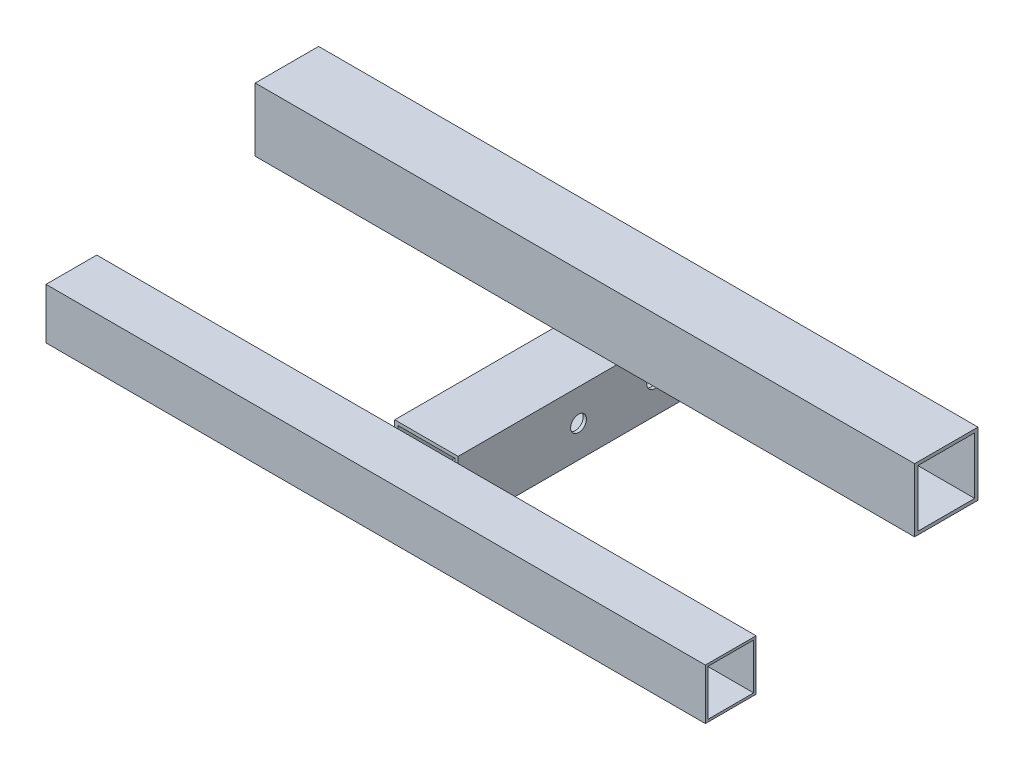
ISO-10303-21;
HEADER;
FILE_DESCRIPTION(('STEP AP214'),'2;1');
FILE_NAME('part.step','',(''),(''),'','','');
FILE_SCHEMA(('AUTOMOTIVE_DESIGN { 1 0 10303 214 1 1 1 1 }'));
ENDSEC;
DATA;
#1=APPLICATION_CONTEXT('core data for automotive mechanical design processes');
#2=APPLICATION_PROTOCOL_DEFINITION('international standard','automotive_design',2000,#1);
#3=PRODUCT_CONTEXT('',#1,'mechanical');
#4=PRODUCT('Part','Part','',(#3));
#5=PRODUCT_RELATED_PRODUCT_CATEGORY('part','',(#4));
#6=PRODUCT_DEFINITION_FORMATION('','',#4);
#7=PRODUCT_DEFINITION_CONTEXT('part definition',#1,'design');
#8=PRODUCT_DEFINITION('design','',#6,#7);
#9=PRODUCT_DEFINITION_SHAPE('','',#8);
#10=(LENGTH_UNIT() NAMED_UNIT(*) SI_UNIT(.MILLI.,.METRE.));
#11=(NAMED_UNIT(*) PLANE_ANGLE_UNIT() SI_UNIT($,.RADIAN.));
#12=(NAMED_UNIT(*) SI_UNIT($,.STERADIAN.) SOLID_ANGLE_UNIT());
#13=UNCERTAINTY_MEASURE_WITH_UNIT(LENGTH_MEASURE(1.E-05),#10,'distance_accuracy_value','');
#14=(GEOMETRIC_REPRESENTATION_CONTEXT(3) GLOBAL_UNCERTAINTY_ASSIGNED_CONTEXT((#13)) GLOBAL_UNIT_ASSIGNED_CONTEXT((#10,
#11,#12)) REPRESENTATION_CONTEXT('',''));
#15=CARTESIAN_POINT('',(0.,0.,0.));
#16=DIRECTION('',(0.,0.,1.));
#17=DIRECTION('',(1.,0.,0.));
#18=AXIS2_PLACEMENT_3D('',#15,#16,#17);
#19=CARTESIAN_POINT('',(165.1,-12.7,-12.7));
#20=DIRECTION('',(1.,0.,0.));
#21=DIRECTION('',(0.,1.,0.));
#22=AXIS2_PLACEMENT_3D('',#19,#20,#21);
#23=PLANE('',#22);
#24=DIRECTION('',(0.,-1.,0.));
#25=VECTOR('',#24,1.);
#26=CARTESIAN_POINT('',(165.1,-12.0904,-11.4808));
#27=LINE('',#26,#25);
#28=CARTESIAN_POINT('',(165.1,11.4808,-11.4808));
#29=VERTEX_POINT('',#28);
#30=CARTESIAN_POINT('',(165.1,-11.4808,-11.4808));
#31=VERTEX_POINT('',#30);
#32=EDGE_CURVE('P0_E181',#29,#31,#27,.T.);
#33=ORIENTED_EDGE('',*,*,#32,.T.);
#34=DIRECTION('',(0.,0.,1.));
#35=VECTOR('',#34,1.);
#36=CARTESIAN_POINT('',(165.1,-11.4808,-12.0904));
#37=LINE('',#36,#35);
#38=CARTESIAN_POINT('',(165.1,-11.4808,11.4808));
#39=VERTEX_POINT('',#38);
#40=EDGE_CURVE('P0_E10',#31,#39,#37,.T.);
#41=ORIENTED_EDGE('',*,*,#40,.T.);
#42=DIRECTION('',(0.,-1.,0.));
#43=VECTOR('',#42,1.);
#44=CARTESIAN_POINT('',(165.1,-12.0904,11.4808));
#45=LINE('',#44,#43);
#46=CARTESIAN_POINT('',(165.1,11.4808,11.4808));
#47=VERTEX_POINT('',#46);
#48=EDGE_CURVE('P0_E45',#47,#39,#45,.T.);
#49=ORIENTED_EDGE('',*,*,#48,.F.);
#50=DIRECTION('',(0.,0.,1.));
#51=VECTOR('',#50,1.);
#52=CARTESIAN_POINT('',(165.1,11.4808,-12.0904));
#53=LINE('',#52,#51);
#54=EDGE_CURVE('P0_E184',#29,#47,#53,.T.);
#55=ORIENTED_EDGE('',*,*,#54,.F.);
#56=EDGE_LOOP('',(#33,#41,#49,#55));
#57=FACE_BOUND('',#56,.T.);
#58=DIRECTION('',(0.,0.,1.));
#59=VECTOR('',#58,1.);
#60=CARTESIAN_POINT('',(165.1,-12.7,-12.7));
#61=LINE('',#60,#59);
#62=CARTESIAN_POINT('',(165.1,-12.7,-12.7));
#63=VERTEX_POINT('',#62);
#64=CARTESIAN_POINT('',(165.1,-12.7,12.7));
#65=VERTEX_POINT('',#64);
#66=EDGE_CURVE('P0_E108',#63,#65,#61,.T.);
#67=ORIENTED_EDGE('',*,*,#66,.F.);
#68=DIRECTION('',(0.,1.,0.));
#69=VECTOR('',#68,1.);
#70=CARTESIAN_POINT('',(165.1,-12.7,-12.7));
#71=LINE('',#70,#69);
#72=CARTESIAN_POINT('',(165.1,12.7,-12.7));
#73=VERTEX_POINT('',#72);
#74=EDGE_CURVE('P0_E139',#63,#73,#71,.T.);
#75=ORIENTED_EDGE('',*,*,#74,.T.);
#76=DIRECTION('',(0.,0.,1.));
#77=VECTOR('',#76,1.);
#78=CARTESIAN_POINT('',(165.1,12.7,-12.7));
#79=LINE('',#78,#77);
#80=CARTESIAN_POINT('',(165.1,12.7,12.7));
#81=VERTEX_POINT('',#80);
#82=EDGE_CURVE('P0_E142',#73,#81,#79,.T.);
#83=ORIENTED_EDGE('',*,*,#82,.T.);
#84=DIRECTION('',(0.,1.,0.));
#85=VECTOR('',#84,1.);
#86=CARTESIAN_POINT('',(165.1,-12.7,12.7));
#87=LINE('',#86,#85);
#88=EDGE_CURVE('P0_E162',#65,#81,#87,.T.);
#89=ORIENTED_EDGE('',*,*,#88,.F.);
#90=EDGE_LOOP('',(#67,#75,#83,#89));
#91=FACE_BOUND('',#90,.T.);
#92=ADVANCED_FACE('P0_F16',(#57,#91),#23,.T.);
#93=CARTESIAN_POINT('',(-190.5,-11.4808,-11.4808));
#94=DIRECTION('',(0.,1.,0.));
#95=DIRECTION('',(1.,0.,0.));
#96=AXIS2_PLACEMENT_3D('',#93,#94,#95);
#97=PLANE('',#96);
#98=DIRECTION('',(1.,0.,0.));
#99=VECTOR('',#98,1.);
#100=CARTESIAN_POINT('',(-190.5,-11.4808,-11.4808));
#101=LINE('',#100,#99);
#102=CARTESIAN_POINT('',(-165.1,-11.4808,-11.4808));
#103=VERTEX_POINT('',#102);
#104=EDGE_CURVE('P0_E178',#103,#31,#101,.T.);
#105=ORIENTED_EDGE('',*,*,#104,.F.);
#106=DIRECTION('',(0.,0.,1.));
#107=VECTOR('',#106,1.);
#108=CARTESIAN_POINT('',(-165.1,-11.4808,-12.0904));
#109=LINE('',#108,#107);
#110=CARTESIAN_POINT('',(-165.1,-11.4808,11.4808));
#111=VERTEX_POINT('',#110);
#112=EDGE_CURVE('P0_E160',#103,#111,#109,.T.);
#113=ORIENTED_EDGE('',*,*,#112,.T.);
#114=DIRECTION('',(1.,0.,0.));
#115=VECTOR('',#114,1.);
#116=CARTESIAN_POINT('',(-190.5,-11.4808,11.4808));
#117=LINE('',#116,#115);
#118=EDGE_CURVE('P0_E20',#111,#39,#117,.T.);
#119=ORIENTED_EDGE('',*,*,#118,.T.);
#120=ORIENTED_EDGE('',*,*,#40,.F.);
#121=EDGE_LOOP('',(#105,#113,#119,#120));
#122=FACE_BOUND('',#121,.T.);
#123=ADVANCED_FACE('P0_F18',(#122),#97,.T.);
#124=CARTESIAN_POINT('',(-190.5,-11.4808,11.4808));
#125=DIRECTION('',(0.,0.,1.));
#126=DIRECTION('',(1.,0.,0.));
#127=AXIS2_PLACEMENT_3D('',#124,#125,#126);
#128=PLANE('',#127);
#129=ORIENTED_EDGE('',*,*,#48,.T.);
#130=ORIENTED_EDGE('',*,*,#118,.F.);
#131=DIRECTION('',(0.,-1.,0.));
#132=VECTOR('',#131,1.);
#133=CARTESIAN_POINT('',(-165.1,-12.0904,11.4808));
#134=LINE('',#133,#132);
#135=CARTESIAN_POINT('',(-165.1,11.4808,11.4808));
#136=VERTEX_POINT('',#135);
#137=EDGE_CURVE('P0_E155',#136,#111,#134,.T.);
#138=ORIENTED_EDGE('',*,*,#137,.F.);
#139=DIRECTION('',(1.,0.,0.));
#140=VECTOR('',#139,1.);
#141=CARTESIAN_POINT('',(-190.5,11.4808,11.4808));
#142=LINE('',#141,#140);
#143=EDGE_CURVE('P0_E188',#136,#47,#142,.T.);
#144=ORIENTED_EDGE('',*,*,#143,.T.);
#145=EDGE_LOOP('',(#129,#130,#138,#144));
#146=FACE_BOUND('',#145,.T.);
#147=ADVANCED_FACE('P0_F203',(#146),#128,.F.);
#148=CARTESIAN_POINT('',(-190.5,11.4808,-11.4808));
#149=DIRECTION('',(0.,1.,0.));
#150=DIRECTION('',(1.,0.,0.));
#151=AXIS2_PLACEMENT_3D('',#148,#149,#150);
#152=PLANE('',#151);
#153=ORIENTED_EDGE('',*,*,#54,.T.);
#154=ORIENTED_EDGE('',*,*,#143,.F.);
#155=DIRECTION('',(0.,0.,1.));
#156=VECTOR('',#155,1.);
#157=CARTESIAN_POINT('',(-165.1,11.4808,-12.0904));
#158=LINE('',#157,#156);
#159=CARTESIAN_POINT('',(-165.1,11.4808,-11.4808));
#160=VERTEX_POINT('',#159);
#161=EDGE_CURVE('P0_E122',#160,#136,#158,.T.);
#162=ORIENTED_EDGE('',*,*,#161,.F.);
#163=DIRECTION('',(1.,0.,0.));
#164=VECTOR('',#163,1.);
#165=CARTESIAN_POINT('',(-190.5,11.4808,-11.4808));
#166=LINE('',#165,#164);
#167=EDGE_CURVE('P0_E173',#160,#29,#166,.T.);
#168=ORIENTED_EDGE('',*,*,#167,.T.);
#169=EDGE_LOOP('',(#153,#154,#162,#168));
#170=FACE_BOUND('',#169,.T.);
#171=ADVANCED_FACE('P0_F206',(#170),#152,.F.);
#172=CARTESIAN_POINT('',(-190.5,-11.4808,-11.4808));
#173=DIRECTION('',(0.,0.,1.));
#174=DIRECTION('',(1.,0.,0.));
#175=AXIS2_PLACEMENT_3D('',#172,#173,#174);
#176=PLANE('',#175);
#177=ORIENTED_EDGE('',*,*,#167,.F.);
#178=DIRECTION('',(0.,-1.,0.));
#179=VECTOR('',#178,1.);
#180=CARTESIAN_POINT('',(-165.1,-12.0904,-11.4808));
#181=LINE('',#180,#179);
#182=EDGE_CURVE('P0_E146',#160,#103,#181,.T.);
#183=ORIENTED_EDGE('',*,*,#182,.T.);
#184=ORIENTED_EDGE('',*,*,#104,.T.);
#185=ORIENTED_EDGE('',*,*,#32,.F.);
#186=EDGE_LOOP('',(#177,#183,#184,#185));
#187=FACE_BOUND('',#186,.T.);
#188=ADVANCED_FACE('P0_F209',(#187),#176,.T.);
#189=CARTESIAN_POINT('',(-165.1,12.7,-12.7));
#190=DIRECTION('',(0.,1.,0.));
#191=DIRECTION('',(1.,0.,0.));
#192=AXIS2_PLACEMENT_3D('',#189,#190,#191);
#193=PLANE('',#192);
#194=DIRECTION('',(1.,0.,0.));
#195=VECTOR('',#194,1.);
#196=CARTESIAN_POINT('',(-165.1,12.7,-12.7));
#197=LINE('',#196,#195);
#198=CARTESIAN_POINT('',(-165.1,12.7,-12.7));
#199=VERTEX_POINT('',#198);
#200=EDGE_CURVE('P0_E141',#199,#73,#197,.T.);
#201=ORIENTED_EDGE('',*,*,#200,.F.);
#202=DIRECTION('',(0.,0.,1.));
#203=VECTOR('',#202,1.);
#204=CARTESIAN_POINT('',(-165.1,12.7,-12.7));
#205=LINE('',#204,#203);
#206=CARTESIAN_POINT('',(-165.1,12.7,12.7));
#207=VERTEX_POINT('',#206);
#208=EDGE_CURVE('P0_E131',#199,#207,#205,.T.);
#209=ORIENTED_EDGE('',*,*,#208,.T.);
#210=DIRECTION('',(1.,0.,0.));
#211=VECTOR('',#210,1.);
#212=CARTESIAN_POINT('',(-165.1,12.7,12.7));
#213=LINE('',#212,#211);
#214=EDGE_CURVE('P0_E128',#207,#81,#213,.T.);
#215=ORIENTED_EDGE('',*,*,#214,.T.);
#216=ORIENTED_EDGE('',*,*,#82,.F.);
#217=EDGE_LOOP('',(#201,#209,#215,#216));
#218=FACE_BOUND('',#217,.T.);
#219=ADVANCED_FACE('P0_F215',(#218),#193,.T.);
#220=CARTESIAN_POINT('',(-165.1,-12.7,-12.7));
#221=DIRECTION('',(0.,0.,1.));
#222=DIRECTION('',(1.,0.,0.));
#223=AXIS2_PLACEMENT_3D('',#220,#221,#222);
#224=PLANE('',#223);
#225=ORIENTED_EDGE('',*,*,#200,.T.);
#226=ORIENTED_EDGE('',*,*,#74,.F.);
#227=DIRECTION('',(1.,0.,0.));
#228=VECTOR('',#227,1.);
#229=CARTESIAN_POINT('',(-165.1,-12.7,-12.7));
#230=LINE('',#229,#228);
#231=CARTESIAN_POINT('',(-165.1,-12.7,-12.7));
#232=VERTEX_POINT('',#231);
#233=EDGE_CURVE('P0_E111',#232,#63,#230,.T.);
#234=ORIENTED_EDGE('',*,*,#233,.F.);
#235=DIRECTION('',(0.,1.,0.));
#236=VECTOR('',#235,1.);
#237=CARTESIAN_POINT('',(-165.1,-12.7,-12.7));
#238=LINE('',#237,#236);
#239=EDGE_CURVE('P0_E125',#232,#199,#238,.T.);
#240=ORIENTED_EDGE('',*,*,#239,.T.);
#241=EDGE_LOOP('',(#225,#226,#234,#240));
#242=FACE_BOUND('',#241,.T.);
#243=ADVANCED_FACE('P0_F218',(#242),#224,.F.);
#244=CARTESIAN_POINT('',(-165.1,-12.7,12.7));
#245=DIRECTION('',(0.,0.,1.));
#246=DIRECTION('',(1.,0.,0.));
#247=AXIS2_PLACEMENT_3D('',#244,#245,#246);
#248=PLANE('',#247);
#249=DIRECTION('',(0.,1.,0.));
#250=VECTOR('',#249,1.);
#251=CARTESIAN_POINT('',(-165.1,-12.7,12.7));
#252=LINE('',#251,#250);
#253=CARTESIAN_POINT('',(-165.1,-12.7,12.7));
#254=VERTEX_POINT('',#253);
#255=EDGE_CURVE('P0_E120',#254,#207,#252,.T.);
#256=ORIENTED_EDGE('',*,*,#255,.F.);
#257=DIRECTION('',(1.,0.,0.));
#258=VECTOR('',#257,1.);
#259=CARTESIAN_POINT('',(-165.1,-12.7,12.7));
#260=LINE('',#259,#258);
#261=EDGE_CURVE('P0_E105',#254,#65,#260,.T.);
#262=ORIENTED_EDGE('',*,*,#261,.T.);
#263=ORIENTED_EDGE('',*,*,#88,.T.);
#264=ORIENTED_EDGE('',*,*,#214,.F.);
#265=EDGE_LOOP('',(#256,#262,#263,#264));
#266=FACE_BOUND('',#265,.T.);
#267=ADVANCED_FACE('P0_F130',(#266),#248,.T.);
#268=CARTESIAN_POINT('',(-165.1,-12.7,-12.7));
#269=DIRECTION('',(0.,1.,0.));
#270=DIRECTION('',(1.,0.,0.));
#271=AXIS2_PLACEMENT_3D('',#268,#269,#270);
#272=PLANE('',#271);
#273=ORIENTED_EDGE('',*,*,#66,.T.);
#274=ORIENTED_EDGE('',*,*,#261,.F.);
#275=DIRECTION('',(0.,0.,1.));
#276=VECTOR('',#275,1.);
#277=CARTESIAN_POINT('',(-165.1,-12.7,-12.7));
#278=LINE('',#277,#276);
#279=EDGE_CURVE('P0_E106',#232,#254,#278,.T.);
#280=ORIENTED_EDGE('',*,*,#279,.F.);
#281=ORIENTED_EDGE('',*,*,#233,.T.);
#282=EDGE_LOOP('',(#273,#274,#280,#281));
#283=FACE_BOUND('',#282,.T.);
#284=ADVANCED_FACE('P0_F102',(#283),#272,.F.);
#285=CARTESIAN_POINT('',(-165.1,-12.7,-12.7));
#286=DIRECTION('',(1.,0.,0.));
#287=DIRECTION('',(0.,1.,0.));
#288=AXIS2_PLACEMENT_3D('',#285,#286,#287);
#289=PLANE('',#288);
#290=ORIENTED_EDGE('',*,*,#161,.T.);
#291=ORIENTED_EDGE('',*,*,#137,.T.);
#292=ORIENTED_EDGE('',*,*,#112,.F.);
#293=ORIENTED_EDGE('',*,*,#182,.F.);
#294=EDGE_LOOP('',(#290,#291,#292,#293));
#295=FACE_BOUND('',#294,.T.);
#296=ORIENTED_EDGE('',*,*,#255,.T.);
#297=ORIENTED_EDGE('',*,*,#208,.F.);
#298=ORIENTED_EDGE('',*,*,#239,.F.);
#299=ORIENTED_EDGE('',*,*,#279,.T.);
#300=EDGE_LOOP('',(#296,#297,#298,#299));
#301=FACE_BOUND('',#300,.T.);
#302=ADVANCED_FACE('P0_F119',(#295,#301),#289,.F.);
#303=CLOSED_SHELL('',(#92,#123,#147,#171,#188,#219,#243,#267,#284,#302));
#304=MANIFOLD_SOLID_BREP('P0_B1',#303);
#305=CARTESIAN_POINT('',(-21.59,0.,-73.025));
#306=DIRECTION('',(1.,0.,0.));
#307=DIRECTION('',(0.,0.,1.));
#308=AXIS2_PLACEMENT_3D('',#305,#306,#307);
#309=CYLINDRICAL_SURFACE('',#308,3.96875);
#310=DIRECTION('',(1.,0.,0.));
#311=VECTOR('',#310,1.);
#312=CARTESIAN_POINT('',(-21.59,0.,-69.05625));
#313=LINE('',#312,#311);
#314=CARTESIAN_POINT('',(14.224,0.,-69.05625));
#315=VERTEX_POINT('',#314);
#316=CARTESIAN_POINT('',(15.875,0.,-69.05625));
#317=VERTEX_POINT('',#316);
#318=EDGE_CURVE('P1_E11',#315,#317,#313,.T.);
#319=ORIENTED_EDGE('',*,*,#318,.F.);
#320=CARTESIAN_POINT('',(14.224,0.,-73.025));
#321=DIRECTION('',(1.,0.,0.));
#322=DIRECTION('',(0.,0.,1.));
#323=AXIS2_PLACEMENT_3D('',#320,#321,#322);
#324=CIRCLE('',#323,3.96875);
#325=EDGE_CURVE('P1_E252',#315,#315,#324,.T.);
#326=ORIENTED_EDGE('',*,*,#325,.F.);
#327=ORIENTED_EDGE('',*,*,#318,.T.);
#328=CARTESIAN_POINT('',(15.875,0.,-73.025));
#329=DIRECTION('',(1.,0.,0.));
#330=DIRECTION('',(0.,0.,1.));
#331=AXIS2_PLACEMENT_3D('',#328,#329,#330);
#332=CIRCLE('',#331,3.96875);
#333=EDGE_CURVE('P1_E241',#317,#317,#332,.T.);
#334=ORIENTED_EDGE('',*,*,#333,.T.);
#335=EDGE_LOOP('',(#319,#326,#327,#334));
#336=FACE_BOUND('',#335,.T.);
#337=ADVANCED_FACE('P1_F17',(#336),#309,.F.);
#338=CARTESIAN_POINT('',(-21.59,0.,-111.125));
#339=DIRECTION('',(1.,0.,0.));
#340=DIRECTION('',(0.,0.,1.));
#341=AXIS2_PLACEMENT_3D('',#338,#339,#340);
#342=CYLINDRICAL_SURFACE('',#341,3.96875);
#343=DIRECTION('',(1.,0.,0.));
#344=VECTOR('',#343,1.);
#345=CARTESIAN_POINT('',(-21.59,0.,-107.15625));
#346=LINE('',#345,#344);
#347=CARTESIAN_POINT('',(14.224,0.,-107.15625));
#348=VERTEX_POINT('',#347);
#349=CARTESIAN_POINT('',(15.875,0.,-107.15625));
#350=VERTEX_POINT('',#349);
#351=EDGE_CURVE('P1_E27',#348,#350,#346,.T.);
#352=ORIENTED_EDGE('',*,*,#351,.F.);
#353=CARTESIAN_POINT('',(14.224,0.,-111.125));
#354=DIRECTION('',(1.,0.,0.));
#355=DIRECTION('',(0.,0.,1.));
#356=AXIS2_PLACEMENT_3D('',#353,#354,#355);
#357=CIRCLE('',#356,3.96875);
#358=EDGE_CURVE('P1_E247',#348,#348,#357,.T.);
#359=ORIENTED_EDGE('',*,*,#358,.F.);
#360=ORIENTED_EDGE('',*,*,#351,.T.);
#361=CARTESIAN_POINT('',(15.875,0.,-111.125));
#362=DIRECTION('',(1.,0.,0.));
#363=DIRECTION('',(0.,0.,1.));
#364=AXIS2_PLACEMENT_3D('',#361,#362,#363);
#365=CIRCLE('',#364,3.96875);
#366=EDGE_CURVE('P1_E258',#350,#350,#365,.T.);
#367=ORIENTED_EDGE('',*,*,#366,.T.);
#368=EDGE_LOOP('',(#352,#359,#360,#367));
#369=FACE_BOUND('',#368,.T.);
#370=ADVANCED_FACE('P1_F271',(#369),#342,.F.);
#371=CARTESIAN_POINT('',(-14.224,-14.224,-149.225));
#372=DIRECTION('',(1.,0.,0.));
#373=DIRECTION('',(0.,1.,0.));
#374=AXIS2_PLACEMENT_3D('',#371,#372,#373);
#375=PLANE('',#374);
#376=CARTESIAN_POINT('',(-14.224,0.,-73.025));
#377=DIRECTION('',(1.,0.,0.));
#378=DIRECTION('',(0.,0.,1.));
#379=AXIS2_PLACEMENT_3D('',#376,#377,#378);
#380=CIRCLE('',#379,3.96875);
#381=CARTESIAN_POINT('',(-14.224,0.,-69.05625));
#382=VERTEX_POINT('',#381);
#383=EDGE_CURVE('P1_E248',#382,#382,#380,.T.);
#384=ORIENTED_EDGE('',*,*,#383,.F.);
#385=EDGE_LOOP('',(#384));
#386=FACE_BOUND('',#385,.T.);
#387=CARTESIAN_POINT('',(-14.224,0.,-111.125));
#388=DIRECTION('',(1.,0.,0.));
#389=DIRECTION('',(0.,0.,1.));
#390=AXIS2_PLACEMENT_3D('',#387,#388,#389);
#391=CIRCLE('',#390,3.96875);
#392=CARTESIAN_POINT('',(-14.224,0.,-107.15625));
#393=VERTEX_POINT('',#392);
#394=EDGE_CURVE('P1_E240',#393,#393,#391,.T.);
#395=ORIENTED_EDGE('',*,*,#394,.F.);
#396=EDGE_LOOP('',(#395));
#397=FACE_BOUND('',#396,.T.);
#398=DIRECTION('',(0.,0.,1.));
#399=VECTOR('',#398,1.);
#400=CARTESIAN_POINT('',(-14.224,-14.224,-149.225));
#401=LINE('',#400,#399);
#402=CARTESIAN_POINT('',(-14.224,-14.224,-123.825));
#403=VERTEX_POINT('',#402);
#404=CARTESIAN_POINT('',(-14.224,-14.224,-12.7));
#405=VERTEX_POINT('',#404);
#406=EDGE_CURVE('P1_E239',#403,#405,#401,.T.);
#407=ORIENTED_EDGE('',*,*,#406,.F.);
#408=DIRECTION('',(0.,1.,0.));
#409=VECTOR('',#408,1.);
#410=CARTESIAN_POINT('',(-14.224,-15.0495,-123.825));
#411=LINE('',#410,#409);
#412=CARTESIAN_POINT('',(-14.224,14.224,-123.825));
#413=VERTEX_POINT('',#412);
#414=EDGE_CURVE('P1_E222',#403,#413,#411,.T.);
#415=ORIENTED_EDGE('',*,*,#414,.T.);
#416=DIRECTION('',(0.,0.,1.));
#417=VECTOR('',#416,1.);
#418=CARTESIAN_POINT('',(-14.224,14.224,-149.225));
#419=LINE('',#418,#417);
#420=CARTESIAN_POINT('',(-14.224,14.224,-12.7));
#421=VERTEX_POINT('',#420);
#422=EDGE_CURVE('P1_E270',#413,#421,#419,.T.);
#423=ORIENTED_EDGE('',*,*,#422,.T.);
#424=DIRECTION('',(0.,1.,0.));
#425=VECTOR('',#424,1.);
#426=CARTESIAN_POINT('',(-14.224,-15.0495,-12.7));
#427=LINE('',#426,#425);
#428=EDGE_CURVE('P1_E197',#405,#421,#427,.T.);
#429=ORIENTED_EDGE('',*,*,#428,.F.);
#430=EDGE_LOOP('',(#407,#415,#423,#429));
#431=FACE_BOUND('',#430,.T.);
#432=ADVANCED_FACE('P1_F19',(#386,#397,#431),#375,.T.);
#433=CARTESIAN_POINT('',(-14.224,14.224,-149.225));
#434=DIRECTION('',(0.,1.,0.));
#435=DIRECTION('',(1.,0.,0.));
#436=AXIS2_PLACEMENT_3D('',#433,#434,#435);
#437=PLANE('',#436);
#438=DIRECTION('',(-1.,0.,0.));
#439=VECTOR('',#438,1.);
#440=CARTESIAN_POINT('',(-15.0495,14.224,-12.7));
#441=LINE('',#440,#439);
#442=CARTESIAN_POINT('',(14.224,14.224,-12.7));
#443=VERTEX_POINT('',#442);
#444=EDGE_CURVE('P1_E175',#443,#421,#441,.T.);
#445=ORIENTED_EDGE('',*,*,#444,.T.);
#446=ORIENTED_EDGE('',*,*,#422,.F.);
#447=DIRECTION('',(-1.,0.,0.));
#448=VECTOR('',#447,1.);
#449=CARTESIAN_POINT('',(-15.0495,14.224,-123.825));
#450=LINE('',#449,#448);
#451=CARTESIAN_POINT('',(14.224,14.224,-123.825));
#452=VERTEX_POINT('',#451);
#453=EDGE_CURVE('P1_E220',#452,#413,#450,.T.);
#454=ORIENTED_EDGE('',*,*,#453,.F.);
#455=DIRECTION('',(0.,0.,1.));
#456=VECTOR('',#455,1.);
#457=CARTESIAN_POINT('',(14.224,14.224,-149.225));
#458=LINE('',#457,#456);
#459=EDGE_CURVE('P1_E251',#452,#443,#458,.T.);
#460=ORIENTED_EDGE('',*,*,#459,.T.);
#461=EDGE_LOOP('',(#445,#446,#454,#460));
#462=FACE_BOUND('',#461,.T.);
#463=ADVANCED_FACE('P1_F279',(#462),#437,.F.);
#464=CARTESIAN_POINT('',(14.224,-14.224,-149.225));
#465=DIRECTION('',(1.,0.,0.));
#466=DIRECTION('',(0.,1.,0.));
#467=AXIS2_PLACEMENT_3D('',#464,#465,#466);
#468=PLANE('',#467);
#469=ORIENTED_EDGE('',*,*,#325,.T.);
#470=EDGE_LOOP('',(#469));
#471=FACE_BOUND('',#470,.T.);
#472=ORIENTED_EDGE('',*,*,#358,.T.);
#473=EDGE_LOOP('',(#472));
#474=FACE_BOUND('',#473,.T.);
#475=DIRECTION('',(0.,1.,0.));
#476=VECTOR('',#475,1.);
#477=CARTESIAN_POINT('',(14.224,-15.0495,-12.7));
#478=LINE('',#477,#476);
#479=CARTESIAN_POINT('',(14.224,-14.224,-12.7));
#480=VERTEX_POINT('',#479);
#481=EDGE_CURVE('P1_E203',#480,#443,#478,.T.);
#482=ORIENTED_EDGE('',*,*,#481,.T.);
#483=ORIENTED_EDGE('',*,*,#459,.F.);
#484=DIRECTION('',(0.,1.,0.));
#485=VECTOR('',#484,1.);
#486=CARTESIAN_POINT('',(14.224,-15.0495,-123.825));
#487=LINE('',#486,#485);
#488=CARTESIAN_POINT('',(14.224,-14.224,-123.825));
#489=VERTEX_POINT('',#488);
#490=EDGE_CURVE('P1_E213',#489,#452,#487,.T.);
#491=ORIENTED_EDGE('',*,*,#490,.F.);
#492=DIRECTION('',(0.,0.,1.));
#493=VECTOR('',#492,1.);
#494=CARTESIAN_POINT('',(14.224,-14.224,-149.225));
#495=LINE('',#494,#493);
#496=EDGE_CURVE('P1_E236',#489,#480,#495,.T.);
#497=ORIENTED_EDGE('',*,*,#496,.T.);
#498=EDGE_LOOP('',(#482,#483,#491,#497));
#499=FACE_BOUND('',#498,.T.);
#500=ADVANCED_FACE('P1_F273',(#471,#474,#499),#468,.F.);
#501=CARTESIAN_POINT('',(-14.224,-14.224,-149.225));
#502=DIRECTION('',(0.,1.,0.));
#503=DIRECTION('',(1.,0.,0.));
#504=AXIS2_PLACEMENT_3D('',#501,#502,#503);
#505=PLANE('',#504);
#506=ORIENTED_EDGE('',*,*,#496,.F.);
#507=DIRECTION('',(-1.,0.,0.));
#508=VECTOR('',#507,1.);
#509=CARTESIAN_POINT('',(-15.0495,-14.224,-123.825));
#510=LINE('',#509,#508);
#511=EDGE_CURVE('P1_E223',#489,#403,#510,.T.);
#512=ORIENTED_EDGE('',*,*,#511,.T.);
#513=ORIENTED_EDGE('',*,*,#406,.T.);
#514=DIRECTION('',(-1.,0.,0.));
#515=VECTOR('',#514,1.);
#516=CARTESIAN_POINT('',(-15.0495,-14.224,-12.7));
#517=LINE('',#516,#515);
#518=EDGE_CURVE('P1_E176',#480,#405,#517,.T.);
#519=ORIENTED_EDGE('',*,*,#518,.F.);
#520=EDGE_LOOP('',(#506,#512,#513,#519));
#521=FACE_BOUND('',#520,.T.);
#522=ADVANCED_FACE('P1_F280',(#521),#505,.T.);
#523=CARTESIAN_POINT('',(15.875,-15.875,-123.825));
#524=DIRECTION('',(1.,0.,0.));
#525=DIRECTION('',(0.,1.,0.));
#526=AXIS2_PLACEMENT_3D('',#523,#524,#525);
#527=PLANE('',#526);
#528=ORIENTED_EDGE('',*,*,#333,.F.);
#529=EDGE_LOOP('',(#528));
#530=FACE_BOUND('',#529,.T.);
#531=ORIENTED_EDGE('',*,*,#366,.F.);
#532=EDGE_LOOP('',(#531));
#533=FACE_BOUND('',#532,.T.);
#534=DIRECTION('',(0.,0.,1.));
#535=VECTOR('',#534,1.);
#536=CARTESIAN_POINT('',(15.875,-15.875,-123.825));
#537=LINE('',#536,#535);
#538=CARTESIAN_POINT('',(15.875,-15.875,-123.825));
#539=VERTEX_POINT('',#538);
#540=CARTESIAN_POINT('',(15.875,-15.875,-12.7));
#541=VERTEX_POINT('',#540);
#542=EDGE_CURVE('P1_E145',#539,#541,#537,.T.);
#543=ORIENTED_EDGE('',*,*,#542,.F.);
#544=DIRECTION('',(0.,1.,0.));
#545=VECTOR('',#544,1.);
#546=CARTESIAN_POINT('',(15.875,-15.875,-123.825));
#547=LINE('',#546,#545);
#548=CARTESIAN_POINT('',(15.875,15.875,-123.825));
#549=VERTEX_POINT('',#548);
#550=EDGE_CURVE('P1_E207',#539,#549,#547,.T.);
#551=ORIENTED_EDGE('',*,*,#550,.T.);
#552=DIRECTION('',(0.,0.,1.));
#553=VECTOR('',#552,1.);
#554=CARTESIAN_POINT('',(15.875,15.875,-123.825));
#555=LINE('',#554,#553);
#556=CARTESIAN_POINT('',(15.875,15.875,-12.7));
#557=VERTEX_POINT('',#556);
#558=EDGE_CURVE('P1_E228',#549,#557,#555,.T.);
#559=ORIENTED_EDGE('',*,*,#558,.T.);
#560=DIRECTION('',(0.,1.,0.));
#561=VECTOR('',#560,1.);
#562=CARTESIAN_POINT('',(15.875,-15.875,-12.7));
#563=LINE('',#562,#561);
#564=EDGE_CURVE('P1_E180',#541,#557,#563,.T.);
#565=ORIENTED_EDGE('',*,*,#564,.F.);
#566=EDGE_LOOP('',(#543,#551,#559,#565));
#567=FACE_BOUND('',#566,.T.);
#568=ADVANCED_FACE('P1_F327',(#530,#533,#567),#527,.T.);
#569=CARTESIAN_POINT('',(-21.59,0.,-73.025));
#570=DIRECTION('',(1.,0.,0.));
#571=DIRECTION('',(0.,0.,1.));
#572=AXIS2_PLACEMENT_3D('',#569,#570,#571);
#573=CYLINDRICAL_SURFACE('',#572,3.96875);
#574=DIRECTION('',(1.,0.,0.));
#575=VECTOR('',#574,1.);
#576=CARTESIAN_POINT('',(-21.59,0.,-69.05625));
#577=LINE('',#576,#575);
#578=CARTESIAN_POINT('',(-15.875,0.,-69.05625));
#579=VERTEX_POINT('',#578);
#580=EDGE_CURVE('P1_E243',#579,#382,#577,.T.);
#581=ORIENTED_EDGE('',*,*,#580,.F.);
#582=CARTESIAN_POINT('',(-15.875,0.,-73.025));
#583=DIRECTION('',(1.,0.,0.));
#584=DIRECTION('',(0.,0.,1.));
#585=AXIS2_PLACEMENT_3D('',#582,#583,#584);
#586=CIRCLE('',#585,3.96875);
#587=EDGE_CURVE('P1_E185',#579,#579,#586,.T.);
#588=ORIENTED_EDGE('',*,*,#587,.F.);
#589=ORIENTED_EDGE('',*,*,#580,.T.);
#590=ORIENTED_EDGE('',*,*,#383,.T.);
#591=EDGE_LOOP('',(#581,#588,#589,#590));
#592=FACE_BOUND('',#591,.T.);
#593=ADVANCED_FACE('P1_F319',(#592),#573,.F.);
#594=CARTESIAN_POINT('',(-21.59,0.,-111.125));
#595=DIRECTION('',(1.,0.,0.));
#596=DIRECTION('',(0.,0.,1.));
#597=AXIS2_PLACEMENT_3D('',#594,#595,#596);
#598=CYLINDRICAL_SURFACE('',#597,3.96875);
#599=DIRECTION('',(1.,0.,0.));
#600=VECTOR('',#599,1.);
#601=CARTESIAN_POINT('',(-21.59,0.,-107.15625));
#602=LINE('',#601,#600);
#603=CARTESIAN_POINT('',(-15.875,0.,-107.15625));
#604=VERTEX_POINT('',#603);
#605=EDGE_CURVE('P1_E235',#604,#393,#602,.T.);
#606=ORIENTED_EDGE('',*,*,#605,.F.);
#607=CARTESIAN_POINT('',(-15.875,0.,-111.125));
#608=DIRECTION('',(1.,0.,0.));
#609=DIRECTION('',(0.,0.,1.));
#610=AXIS2_PLACEMENT_3D('',#607,#608,#609);
#611=CIRCLE('',#610,3.96875);
#612=EDGE_CURVE('P1_E157',#604,#604,#611,.T.);
#613=ORIENTED_EDGE('',*,*,#612,.F.);
#614=ORIENTED_EDGE('',*,*,#605,.T.);
#615=ORIENTED_EDGE('',*,*,#394,.T.);
#616=EDGE_LOOP('',(#606,#613,#614,#615));
#617=FACE_BOUND('',#616,.T.);
#618=ADVANCED_FACE('P1_F316',(#617),#598,.F.);
#619=CARTESIAN_POINT('',(-15.875,15.875,-123.825));
#620=DIRECTION('',(0.,1.,0.));
#621=DIRECTION('',(1.,0.,0.));
#622=AXIS2_PLACEMENT_3D('',#619,#620,#621);
#623=PLANE('',#622);
#624=DIRECTION('',(1.,0.,0.));
#625=VECTOR('',#624,1.);
#626=CARTESIAN_POINT('',(-15.875,15.875,-123.825));
#627=LINE('',#626,#625);
#628=CARTESIAN_POINT('',(-15.875,15.875,-123.825));
#629=VERTEX_POINT('',#628);
#630=EDGE_CURVE('P1_E202',#629,#549,#627,.T.);
#631=ORIENTED_EDGE('',*,*,#630,.F.);
#632=DIRECTION('',(0.,0.,1.));
#633=VECTOR('',#632,1.);
#634=CARTESIAN_POINT('',(-15.875,15.875,-123.825));
#635=LINE('',#634,#633);
#636=CARTESIAN_POINT('',(-15.875,15.875,-12.7));
#637=VERTEX_POINT('',#636);
#638=EDGE_CURVE('P1_E167',#629,#637,#635,.T.);
#639=ORIENTED_EDGE('',*,*,#638,.T.);
#640=DIRECTION('',(1.,0.,0.));
#641=VECTOR('',#640,1.);
#642=CARTESIAN_POINT('',(-15.875,15.875,-12.7));
#643=LINE('',#642,#641);
#644=EDGE_CURVE('P1_E162',#637,#557,#643,.T.);
#645=ORIENTED_EDGE('',*,*,#644,.T.);
#646=ORIENTED_EDGE('',*,*,#558,.F.);
#647=EDGE_LOOP('',(#631,#639,#645,#646));
#648=FACE_BOUND('',#647,.T.);
#649=ADVANCED_FACE('P1_F317',(#648),#623,.T.);
#650=CARTESIAN_POINT('',(-15.875,-15.875,-123.825));
#651=DIRECTION('',(0.,0.,1.));
#652=DIRECTION('',(1.,0.,0.));
#653=AXIS2_PLACEMENT_3D('',#650,#651,#652);
#654=PLANE('',#653);
#655=ORIENTED_EDGE('',*,*,#490,.T.);
#656=ORIENTED_EDGE('',*,*,#453,.T.);
#657=ORIENTED_EDGE('',*,*,#414,.F.);
#658=ORIENTED_EDGE('',*,*,#511,.F.);
#659=EDGE_LOOP('',(#655,#656,#657,#658));
#660=FACE_BOUND('',#659,.T.);
#661=ORIENTED_EDGE('',*,*,#630,.T.);
#662=ORIENTED_EDGE('',*,*,#550,.F.);
#663=DIRECTION('',(1.,0.,0.));
#664=VECTOR('',#663,1.);
#665=CARTESIAN_POINT('',(-15.875,-15.875,-123.825));
#666=LINE('',#665,#664);
#667=CARTESIAN_POINT('',(-15.875,-15.875,-123.825));
#668=VERTEX_POINT('',#667);
#669=EDGE_CURVE('P1_E149',#668,#539,#666,.T.);
#670=ORIENTED_EDGE('',*,*,#669,.F.);
#671=DIRECTION('',(0.,1.,0.));
#672=VECTOR('',#671,1.);
#673=CARTESIAN_POINT('',(-15.875,-15.875,-123.825));
#674=LINE('',#673,#672);
#675=EDGE_CURVE('P1_E160',#668,#629,#674,.T.);
#676=ORIENTED_EDGE('',*,*,#675,.T.);
#677=EDGE_LOOP('',(#661,#662,#670,#676));
#678=FACE_BOUND('',#677,.T.);
#679=ADVANCED_FACE('P1_F296',(#660,#678),#654,.F.);
#680=CARTESIAN_POINT('',(-15.875,-15.875,-12.7));
#681=DIRECTION('',(0.,0.,1.));
#682=DIRECTION('',(1.,0.,0.));
#683=AXIS2_PLACEMENT_3D('',#680,#681,#682);
#684=PLANE('',#683);
#685=ORIENTED_EDGE('',*,*,#518,.T.);
#686=ORIENTED_EDGE('',*,*,#428,.T.);
#687=ORIENTED_EDGE('',*,*,#444,.F.);
#688=ORIENTED_EDGE('',*,*,#481,.F.);
#689=EDGE_LOOP('',(#685,#686,#687,#688));
#690=FACE_BOUND('',#689,.T.);
#691=DIRECTION('',(0.,1.,0.));
#692=VECTOR('',#691,1.);
#693=CARTESIAN_POINT('',(-15.875,-15.875,-12.7));
#694=LINE('',#693,#692);
#695=CARTESIAN_POINT('',(-15.875,-15.875,-12.7));
#696=VERTEX_POINT('',#695);
#697=EDGE_CURVE('P1_E154',#696,#637,#694,.T.);
#698=ORIENTED_EDGE('',*,*,#697,.F.);
#699=DIRECTION('',(1.,0.,0.));
#700=VECTOR('',#699,1.);
#701=CARTESIAN_POINT('',(-15.875,-15.875,-12.7));
#702=LINE('',#701,#700);
#703=EDGE_CURVE('P1_E140',#696,#541,#702,.T.);
#704=ORIENTED_EDGE('',*,*,#703,.T.);
#705=ORIENTED_EDGE('',*,*,#564,.T.);
#706=ORIENTED_EDGE('',*,*,#644,.F.);
#707=EDGE_LOOP('',(#698,#704,#705,#706));
#708=FACE_BOUND('',#707,.T.);
#709=ADVANCED_FACE('P1_F161',(#690,#708),#684,.T.);
#710=CARTESIAN_POINT('',(-15.875,-15.875,-123.825));
#711=DIRECTION('',(0.,1.,0.));
#712=DIRECTION('',(1.,0.,0.));
#713=AXIS2_PLACEMENT_3D('',#710,#711,#712);
#714=PLANE('',#713);
#715=ORIENTED_EDGE('',*,*,#542,.T.);
#716=ORIENTED_EDGE('',*,*,#703,.F.);
#717=DIRECTION('',(0.,0.,1.));
#718=VECTOR('',#717,1.);
#719=CARTESIAN_POINT('',(-15.875,-15.875,-123.825));
#720=LINE('',#719,#718);
#721=EDGE_CURVE('P1_E143',#668,#696,#720,.T.);
#722=ORIENTED_EDGE('',*,*,#721,.F.);
#723=ORIENTED_EDGE('',*,*,#669,.T.);
#724=EDGE_LOOP('',(#715,#716,#722,#723));
#725=FACE_BOUND('',#724,.T.);
#726=ADVANCED_FACE('P1_F137',(#725),#714,.F.);
#727=CARTESIAN_POINT('',(-15.875,-15.875,-123.825));
#728=DIRECTION('',(1.,0.,0.));
#729=DIRECTION('',(0.,1.,0.));
#730=AXIS2_PLACEMENT_3D('',#727,#728,#729);
#731=PLANE('',#730);
#732=ORIENTED_EDGE('',*,*,#587,.T.);
#733=EDGE_LOOP('',(#732));
#734=FACE_BOUND('',#733,.T.);
#735=ORIENTED_EDGE('',*,*,#612,.T.);
#736=EDGE_LOOP('',(#735));
#737=FACE_BOUND('',#736,.T.);
#738=ORIENTED_EDGE('',*,*,#697,.T.);
#739=ORIENTED_EDGE('',*,*,#638,.F.);
#740=ORIENTED_EDGE('',*,*,#675,.F.);
#741=ORIENTED_EDGE('',*,*,#721,.T.);
#742=EDGE_LOOP('',(#738,#739,#740,#741));
#743=FACE_BOUND('',#742,.T.);
#744=ADVANCED_FACE('P1_F153',(#734,#737,#743),#731,.F.);
#745=CLOSED_SHELL('',(#337,#370,#432,#463,#500,#522,#568,#593,#618,#649,#679,#709,#726,#744));
#746=MANIFOLD_SOLID_BREP('P1_B1',#745);
#747=CARTESIAN_POINT('',(165.1,15.875,-123.825));
#748=DIRECTION('',(1.,0.,0.));
#749=DIRECTION('',(0.,1.,0.));
#750=AXIS2_PLACEMENT_3D('',#747,#748,#749);
#751=PLANE('',#750);
#752=DIRECTION('',(0.,-1.,0.));
#753=VECTOR('',#752,1.);
#754=CARTESIAN_POINT('',(165.1,16.7005,-122.174));
#755=LINE('',#754,#753);
#756=CARTESIAN_POINT('',(165.1,45.974,-122.174));
#757=VERTEX_POINT('',#756);
#758=CARTESIAN_POINT('',(165.1,17.526,-122.174));
#759=VERTEX_POINT('',#758);
#760=EDGE_CURVE('P2_E96',#757,#759,#755,.T.);
#761=ORIENTED_EDGE('',*,*,#760,.T.);
#762=DIRECTION('',(0.,0.,1.));
#763=VECTOR('',#762,1.);
#764=CARTESIAN_POINT('',(165.1,17.526,-122.9995));
#765=LINE('',#764,#763);
#766=CARTESIAN_POINT('',(165.1,17.526,-93.726));
#767=VERTEX_POINT('',#766);
#768=EDGE_CURVE('P2_E10',#759,#767,#765,.T.);
#769=ORIENTED_EDGE('',*,*,#768,.T.);
#770=DIRECTION('',(0.,-1.,0.));
#771=VECTOR('',#770,1.);
#772=CARTESIAN_POINT('',(165.1,16.7005,-93.726));
#773=LINE('',#772,#771);
#774=CARTESIAN_POINT('',(165.1,45.974,-93.726));
#775=VERTEX_POINT('',#774);
#776=EDGE_CURVE('P2_E121',#775,#767,#773,.T.);
#777=ORIENTED_EDGE('',*,*,#776,.F.);
#778=DIRECTION('',(0.,0.,1.));
#779=VECTOR('',#778,1.);
#780=CARTESIAN_POINT('',(165.1,45.974,-122.9995));
#781=LINE('',#780,#779);
#782=EDGE_CURVE('P2_E97',#757,#775,#781,.T.);
#783=ORIENTED_EDGE('',*,*,#782,.F.);
#784=EDGE_LOOP('',(#761,#769,#777,#783));
#785=FACE_BOUND('',#784,.T.);
#786=DIRECTION('',(0.,0.,1.));
#787=VECTOR('',#786,1.);
#788=CARTESIAN_POINT('',(165.1,15.875,-123.825));
#789=LINE('',#788,#787);
#790=CARTESIAN_POINT('',(165.1,15.875,-123.825));
#791=VERTEX_POINT('',#790);
#792=CARTESIAN_POINT('',(165.1,15.875,-92.075));
#793=VERTEX_POINT('',#792);
#794=EDGE_CURVE('P2_E152',#791,#793,#789,.T.);
#795=ORIENTED_EDGE('',*,*,#794,.F.);
#796=DIRECTION('',(0.,1.,0.));
#797=VECTOR('',#796,1.);
#798=CARTESIAN_POINT('',(165.1,15.875,-123.825));
#799=LINE('',#798,#797);
#800=CARTESIAN_POINT('',(165.1,47.625,-123.825));
#801=VERTEX_POINT('',#800);
#802=EDGE_CURVE('P2_E164',#791,#801,#799,.T.);
#803=ORIENTED_EDGE('',*,*,#802,.T.);
#804=DIRECTION('',(0.,0.,1.));
#805=VECTOR('',#804,1.);
#806=CARTESIAN_POINT('',(165.1,47.625,-123.825));
#807=LINE('',#806,#805);
#808=CARTESIAN_POINT('',(165.1,47.625,-92.075));
#809=VERTEX_POINT('',#808);
#810=EDGE_CURVE('P2_E111',#801,#809,#807,.T.);
#811=ORIENTED_EDGE('',*,*,#810,.T.);
#812=DIRECTION('',(0.,1.,0.));
#813=VECTOR('',#812,1.);
#814=CARTESIAN_POINT('',(165.1,15.875,-92.075));
#815=LINE('',#814,#813);
#816=EDGE_CURVE('P2_E174',#793,#809,#815,.T.);
#817=ORIENTED_EDGE('',*,*,#816,.F.);
#818=EDGE_LOOP('',(#795,#803,#811,#817));
#819=FACE_BOUND('',#818,.T.);
#820=ADVANCED_FACE('P2_F16',(#785,#819),#751,.T.);
#821=CARTESIAN_POINT('',(-190.5,17.526,-122.174));
#822=DIRECTION('',(0.,1.,0.));
#823=DIRECTION('',(1.,0.,0.));
#824=AXIS2_PLACEMENT_3D('',#821,#822,#823);
#825=PLANE('',#824);
#826=DIRECTION('',(1.,0.,0.));
#827=VECTOR('',#826,1.);
#828=CARTESIAN_POINT('',(-190.5,17.526,-122.174));
#829=LINE('',#828,#827);
#830=CARTESIAN_POINT('',(-165.1,17.526,-122.174));
#831=VERTEX_POINT('',#830);
#832=EDGE_CURVE('P2_E95',#831,#759,#829,.T.);
#833=ORIENTED_EDGE('',*,*,#832,.F.);
#834=DIRECTION('',(0.,0.,1.));
#835=VECTOR('',#834,1.);
#836=CARTESIAN_POINT('',(-165.1,17.526,-122.9995));
#837=LINE('',#836,#835);
#838=CARTESIAN_POINT('',(-165.1,17.526,-93.726));
#839=VERTEX_POINT('',#838);
#840=EDGE_CURVE('P2_E142',#831,#839,#837,.T.);
#841=ORIENTED_EDGE('',*,*,#840,.T.);
#842=DIRECTION('',(1.,0.,0.));
#843=VECTOR('',#842,1.);
#844=CARTESIAN_POINT('',(-190.5,17.526,-93.726));
#845=LINE('',#844,#843);
#846=EDGE_CURVE('P2_E25',#839,#767,#845,.T.);
#847=ORIENTED_EDGE('',*,*,#846,.T.);
#848=ORIENTED_EDGE('',*,*,#768,.F.);
#849=EDGE_LOOP('',(#833,#841,#847,#848));
#850=FACE_BOUND('',#849,.T.);
#851=ADVANCED_FACE('P2_F90',(#850),#825,.T.);
#852=CARTESIAN_POINT('',(-190.5,17.526,-93.726));
#853=DIRECTION('',(0.,0.,1.));
#854=DIRECTION('',(1.,0.,0.));
#855=AXIS2_PLACEMENT_3D('',#852,#853,#854);
#856=PLANE('',#855);
#857=ORIENTED_EDGE('',*,*,#776,.T.);
#858=ORIENTED_EDGE('',*,*,#846,.F.);
#859=DIRECTION('',(0.,-1.,0.));
#860=VECTOR('',#859,1.);
#861=CARTESIAN_POINT('',(-165.1,16.7005,-93.726));
#862=LINE('',#861,#860);
#863=CARTESIAN_POINT('',(-165.1,45.974,-93.726));
#864=VERTEX_POINT('',#863);
#865=EDGE_CURVE('P2_E138',#864,#839,#862,.T.);
#866=ORIENTED_EDGE('',*,*,#865,.F.);
#867=DIRECTION('',(1.,0.,0.));
#868=VECTOR('',#867,1.);
#869=CARTESIAN_POINT('',(-190.5,45.974,-93.726));
#870=LINE('',#869,#868);
#871=EDGE_CURVE('P2_E119',#864,#775,#870,.T.);
#872=ORIENTED_EDGE('',*,*,#871,.T.);
#873=EDGE_LOOP('',(#857,#858,#866,#872));
#874=FACE_BOUND('',#873,.T.);
#875=ADVANCED_FACE('P2_F222',(#874),#856,.F.);
#876=CARTESIAN_POINT('',(-190.5,45.974,-122.174));
#877=DIRECTION('',(0.,1.,0.));
#878=DIRECTION('',(1.,0.,0.));
#879=AXIS2_PLACEMENT_3D('',#876,#877,#878);
#880=PLANE('',#879);
#881=ORIENTED_EDGE('',*,*,#782,.T.);
#882=ORIENTED_EDGE('',*,*,#871,.F.);
#883=DIRECTION('',(0.,0.,1.));
#884=VECTOR('',#883,1.);
#885=CARTESIAN_POINT('',(-165.1,45.974,-122.9995));
#886=LINE('',#885,#884);
#887=CARTESIAN_POINT('',(-165.1,45.974,-122.174));
#888=VERTEX_POINT('',#887);
#889=EDGE_CURVE('P2_E141',#888,#864,#886,.T.);
#890=ORIENTED_EDGE('',*,*,#889,.F.);
#891=DIRECTION('',(1.,0.,0.));
#892=VECTOR('',#891,1.);
#893=CARTESIAN_POINT('',(-190.5,45.974,-122.174));
#894=LINE('',#893,#892);
#895=EDGE_CURVE('P2_E109',#888,#757,#894,.T.);
#896=ORIENTED_EDGE('',*,*,#895,.T.);
#897=EDGE_LOOP('',(#881,#882,#890,#896));
#898=FACE_BOUND('',#897,.T.);
#899=ADVANCED_FACE('P2_F226',(#898),#880,.F.);
#900=CARTESIAN_POINT('',(-190.5,17.526,-122.174));
#901=DIRECTION('',(0.,0.,1.));
#902=DIRECTION('',(1.,0.,0.));
#903=AXIS2_PLACEMENT_3D('',#900,#901,#902);
#904=PLANE('',#903);
#905=ORIENTED_EDGE('',*,*,#895,.F.);
#906=DIRECTION('',(0.,-1.,0.));
#907=VECTOR('',#906,1.);
#908=CARTESIAN_POINT('',(-165.1,16.7005,-122.174));
#909=LINE('',#908,#907);
#910=EDGE_CURVE('P2_E110',#888,#831,#909,.T.);
#911=ORIENTED_EDGE('',*,*,#910,.T.);
#912=ORIENTED_EDGE('',*,*,#832,.T.);
#913=ORIENTED_EDGE('',*,*,#760,.F.);
#914=EDGE_LOOP('',(#905,#911,#912,#913));
#915=FACE_BOUND('',#914,.T.);
#916=ADVANCED_FACE('P2_F104',(#915),#904,.T.);
#917=CARTESIAN_POINT('',(-165.1,47.625,-123.825));
#918=DIRECTION('',(0.,1.,0.));
#919=DIRECTION('',(1.,0.,0.));
#920=AXIS2_PLACEMENT_3D('',#917,#918,#919);
#921=PLANE('',#920);
#922=DIRECTION('',(1.,0.,0.));
#923=VECTOR('',#922,1.);
#924=CARTESIAN_POINT('',(-165.1,47.625,-123.825));
#925=LINE('',#924,#923);
#926=CARTESIAN_POINT('',(-165.1,47.625,-123.825));
#927=VERTEX_POINT('',#926);
#928=EDGE_CURVE('P2_E166',#927,#801,#925,.T.);
#929=ORIENTED_EDGE('',*,*,#928,.F.);
#930=DIRECTION('',(0.,0.,1.));
#931=VECTOR('',#930,1.);
#932=CARTESIAN_POINT('',(-165.1,47.625,-123.825));
#933=LINE('',#932,#931);
#934=CARTESIAN_POINT('',(-165.1,47.625,-92.075));
#935=VERTEX_POINT('',#934);
#936=EDGE_CURVE('P2_E135',#927,#935,#933,.T.);
#937=ORIENTED_EDGE('',*,*,#936,.T.);
#938=DIRECTION('',(1.,0.,0.));
#939=VECTOR('',#938,1.);
#940=CARTESIAN_POINT('',(-165.1,47.625,-92.075));
#941=LINE('',#940,#939);
#942=EDGE_CURVE('P2_E180',#935,#809,#941,.T.);
#943=ORIENTED_EDGE('',*,*,#942,.T.);
#944=ORIENTED_EDGE('',*,*,#810,.F.);
#945=EDGE_LOOP('',(#929,#937,#943,#944));
#946=FACE_BOUND('',#945,.T.);
#947=ADVANCED_FACE('P2_F187',(#946),#921,.T.);
#948=CARTESIAN_POINT('',(-165.1,15.875,-123.825));
#949=DIRECTION('',(0.,0.,1.));
#950=DIRECTION('',(1.,0.,0.));
#951=AXIS2_PLACEMENT_3D('',#948,#949,#950);
#952=PLANE('',#951);
#953=ORIENTED_EDGE('',*,*,#928,.T.);
#954=ORIENTED_EDGE('',*,*,#802,.F.);
#955=DIRECTION('',(1.,0.,0.));
#956=VECTOR('',#955,1.);
#957=CARTESIAN_POINT('',(-165.1,15.875,-123.825));
#958=LINE('',#957,#956);
#959=CARTESIAN_POINT('',(-165.1,15.875,-123.825));
#960=VERTEX_POINT('',#959);
#961=EDGE_CURVE('P2_E161',#960,#791,#958,.T.);
#962=ORIENTED_EDGE('',*,*,#961,.F.);
#963=DIRECTION('',(0.,1.,0.));
#964=VECTOR('',#963,1.);
#965=CARTESIAN_POINT('',(-165.1,15.875,-123.825));
#966=LINE('',#965,#964);
#967=EDGE_CURVE('P2_E133',#960,#927,#966,.T.);
#968=ORIENTED_EDGE('',*,*,#967,.T.);
#969=EDGE_LOOP('',(#953,#954,#962,#968));
#970=FACE_BOUND('',#969,.T.);
#971=ADVANCED_FACE('P2_F203',(#970),#952,.F.);
#972=CARTESIAN_POINT('',(-165.1,15.875,-92.075));
#973=DIRECTION('',(0.,0.,1.));
#974=DIRECTION('',(1.,0.,0.));
#975=AXIS2_PLACEMENT_3D('',#972,#973,#974);
#976=PLANE('',#975);
#977=DIRECTION('',(0.,1.,0.));
#978=VECTOR('',#977,1.);
#979=CARTESIAN_POINT('',(-165.1,15.875,-92.075));
#980=LINE('',#979,#978);
#981=CARTESIAN_POINT('',(-165.1,15.875,-92.075));
#982=VERTEX_POINT('',#981);
#983=EDGE_CURVE('P2_E194',#982,#935,#980,.T.);
#984=ORIENTED_EDGE('',*,*,#983,.F.);
#985=DIRECTION('',(1.,0.,0.));
#986=VECTOR('',#985,1.);
#987=CARTESIAN_POINT('',(-165.1,15.875,-92.075));
#988=LINE('',#987,#986);
#989=EDGE_CURVE('P2_E160',#982,#793,#988,.T.);
#990=ORIENTED_EDGE('',*,*,#989,.T.);
#991=ORIENTED_EDGE('',*,*,#816,.T.);
#992=ORIENTED_EDGE('',*,*,#942,.F.);
#993=EDGE_LOOP('',(#984,#990,#991,#992));
#994=FACE_BOUND('',#993,.T.);
#995=ADVANCED_FACE('P2_F193',(#994),#976,.T.);
#996=CARTESIAN_POINT('',(-165.1,15.875,-123.825));
#997=DIRECTION('',(0.,1.,0.));
#998=DIRECTION('',(1.,0.,0.));
#999=AXIS2_PLACEMENT_3D('',#996,#997,#998);
#1000=PLANE('',#999);
#1001=ORIENTED_EDGE('',*,*,#794,.T.);
#1002=ORIENTED_EDGE('',*,*,#989,.F.);
#1003=DIRECTION('',(0.,0.,1.));
#1004=VECTOR('',#1003,1.);
#1005=CARTESIAN_POINT('',(-165.1,15.875,-123.825));
#1006=LINE('',#1005,#1004);
#1007=EDGE_CURVE('P2_E140',#960,#982,#1006,.T.);
#1008=ORIENTED_EDGE('',*,*,#1007,.F.);
#1009=ORIENTED_EDGE('',*,*,#961,.T.);
#1010=EDGE_LOOP('',(#1001,#1002,#1008,#1009));
#1011=FACE_BOUND('',#1010,.T.);
#1012=ADVANCED_FACE('P2_F196',(#1011),#1000,.F.);
#1013=CARTESIAN_POINT('',(-165.1,15.875,-123.825));
#1014=DIRECTION('',(1.,0.,0.));
#1015=DIRECTION('',(0.,1.,0.));
#1016=AXIS2_PLACEMENT_3D('',#1013,#1014,#1015);
#1017=PLANE('',#1016);
#1018=ORIENTED_EDGE('',*,*,#889,.T.);
#1019=ORIENTED_EDGE('',*,*,#865,.T.);
#1020=ORIENTED_EDGE('',*,*,#840,.F.);
#1021=ORIENTED_EDGE('',*,*,#910,.F.);
#1022=EDGE_LOOP('',(#1018,#1019,#1020,#1021));
#1023=FACE_BOUND('',#1022,.T.);
#1024=ORIENTED_EDGE('',*,*,#983,.T.);
#1025=ORIENTED_EDGE('',*,*,#936,.F.);
#1026=ORIENTED_EDGE('',*,*,#967,.F.);
#1027=ORIENTED_EDGE('',*,*,#1007,.T.);
#1028=EDGE_LOOP('',(#1024,#1025,#1026,#1027));
#1029=FACE_BOUND('',#1028,.T.);
#1030=ADVANCED_FACE('P2_F201',(#1023,#1029),#1017,.F.);
#1031=CLOSED_SHELL('',(#820,#851,#875,#899,#916,#947,#971,#995,#1012,#1030));
#1032=MANIFOLD_SOLID_BREP('P2_B1',#1031);
#1033=ADVANCED_BREP_SHAPE_REPRESENTATION('',(#18,#304,#746,#1032),#14);
#1034=SHAPE_DEFINITION_REPRESENTATION(#9,#1033);
ENDSEC;
END-ISO-10303-21;
